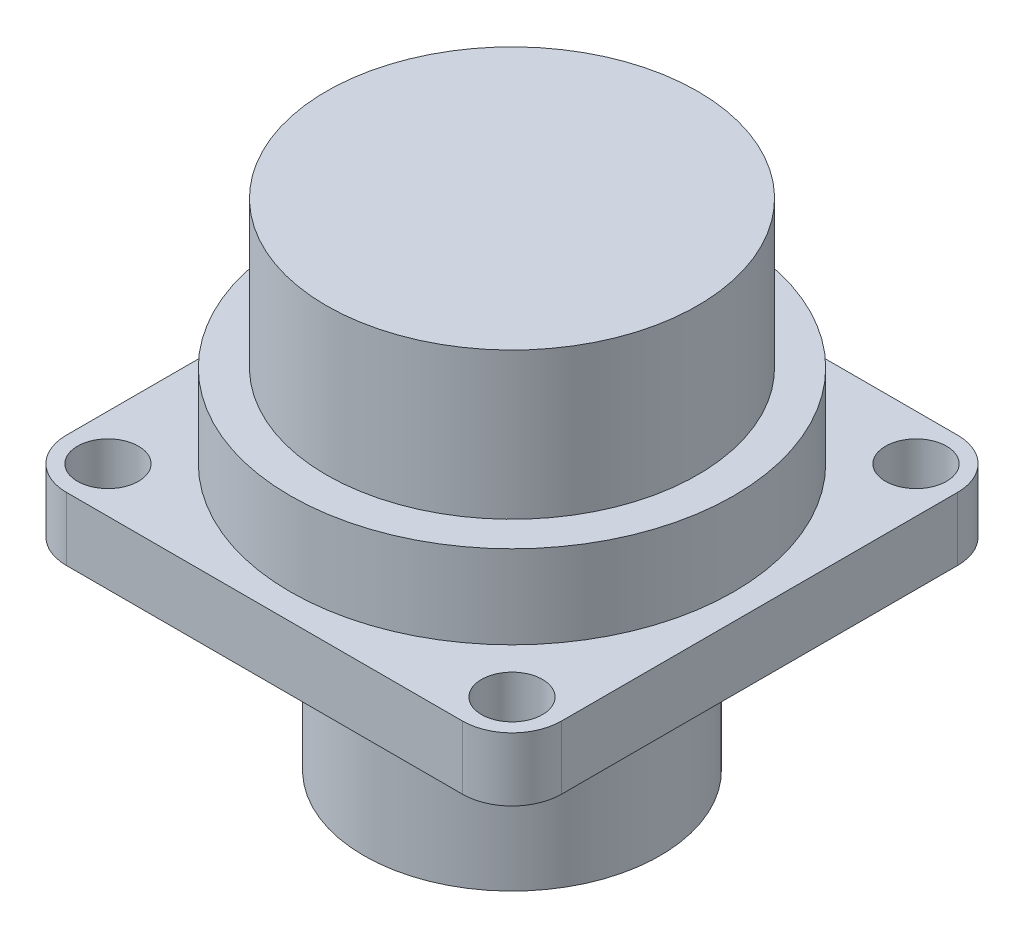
from build123d import *

# Parameters (mm, degrees)
SKETCH2_R           = 1.9558
BASE_EXTRUDE_DEPTH  = 4.064
SKETCH3_R           = 14.224
BOSS_EXTRUDE1_DEPTH = 5.334
SKETCH4_R           = 11.90625
BOSS_EXTRUDE2_DEPTH = 9.398
SKETCH5_R           = 9.4996
BOSS_EXTRUDE3_DEPTH = 12.954


with BuildPart() as part:
    # Sketch2 → Base-Extrude (new body)
    with BuildSketch(Plane(origin=(0, 0, 0), x_dir=(1, 0, 0), z_dir=(0, 1, 0))):
        with BuildLine():
            Line((12.7, 15.875), (-12.7, 15.875))
            ThreePointArc((-12.7, 15.875), (-14.94506403, 14.94506403), (-15.875, 12.7))
            Line((-15.875, 12.7), (-15.875, -12.7))
            ThreePointArc((-15.875, -12.7), (-14.94506403, -14.94506403), (-12.7, -15.875))
            Line((-12.7, -15.875), (12.7, -15.875))
            ThreePointArc((12.7, -15.875), (14.94506403, -14.94506403), (15.875, -12.7))
            Line((15.875, -12.7), (15.875, 12.7))
            ThreePointArc((15.875, 12.7), (14.94506403, 14.94506403), (12.7, 15.875))
        make_face()
        with Locations(Location((-12.954, 12.954, 0), (0, 0, 270))):
            Circle(SKETCH2_R, mode=Mode.SUBTRACT)
        with Locations(Location((-12.954, -12.954, 0), (0, 0, 90))):
            Circle(SKETCH2_R, mode=Mode.SUBTRACT)
        with Locations(Location((12.954, -12.954, 0), (0, 0, 270))):
            Circle(SKETCH2_R, mode=Mode.SUBTRACT)
        with Locations(Location((12.954, 12.954, 0), (0, 0, 90))):
            Circle(SKETCH2_R, mode=Mode.SUBTRACT)
    extrude(amount=BASE_EXTRUDE_DEPTH)

    # Sketch3 → Boss-Extrude1 (add)
    with BuildSketch(Plane(origin=(0, 4.064, 0), x_dir=(-1, 0, 0), z_dir=(0, 1, 0))):
        with Locations(Location((0, 0, 0), (0, 0, 90))):
            Circle(SKETCH3_R)
    extrude(amount=BOSS_EXTRUDE1_DEPTH)

    # Sketch4 → Boss-Extrude2 (add)
    with BuildSketch(Plane(origin=(0, 9.398, 0), x_dir=(-1, 0, 0), z_dir=(0, 1, 0))):
        with Locations(Location((0, 0, 0), (0, 0, 90))):
            Circle(SKETCH4_R)
    extrude(amount=BOSS_EXTRUDE2_DEPTH)

    # Sketch5 → Boss-Extrude3 (add)
    with BuildSketch(Plane.XZ):
        with Locations(Location((0, 0, 0), (0, 0, 270))):
            Circle(SKETCH5_R)
    extrude(amount=BOSS_EXTRUDE3_DEPTH)


solid = part.part
